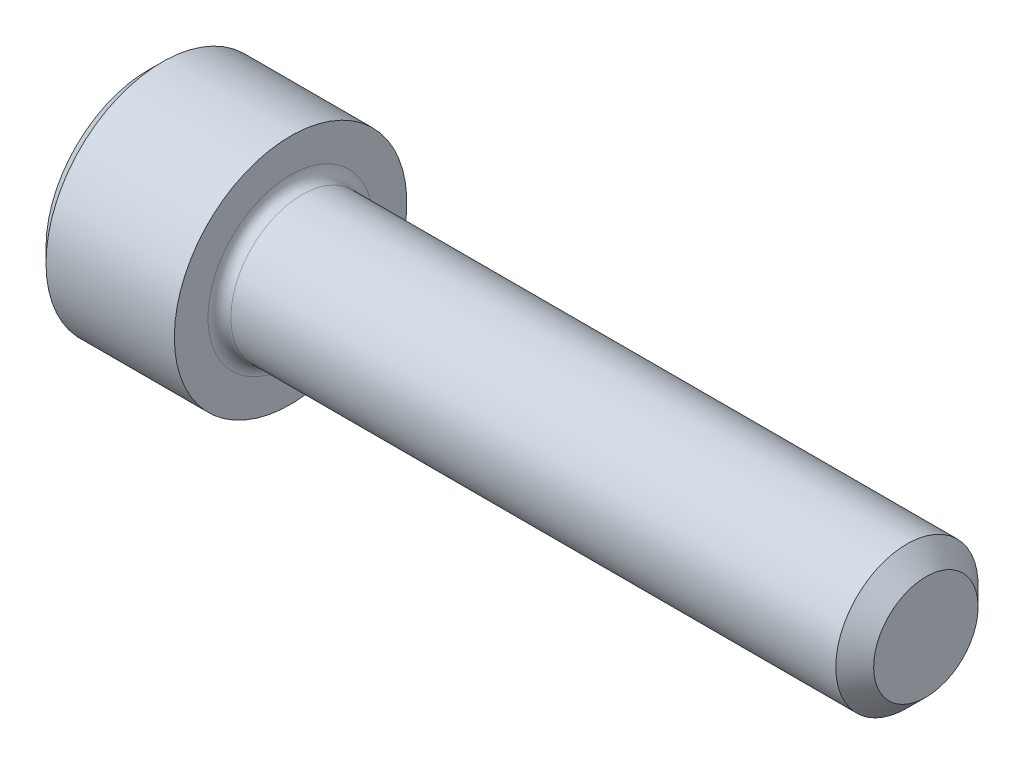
from build123d import *

# Parameters (mm, degrees)
FILLET1_R   = 0.2286
HEX_2_DEPTH = 1.2954


with BuildPart() as part:
    # BodySke → Base-Revolve (revolve)
    with BuildSketch(Plane.XY, mode=Mode.PRIVATE) as base_revolve_sk:
        Polygon((0, 0), (0, 2.0447), (0.2794, 2.3241), (2.8448, 2.3241), (2.8448, 1.4224), (15.16634, 1.4224), (15.5448, 1.04394), (15.5448, 0), align=None)
    revolve(base_revolve_sk.sketch.rotate(Axis((-31.75, 0, 0), (1, 0, 0)), 90), axis=Axis((-31.75, 0, 0), (1, 0, 0)))

    # Fillet1
    fillet1_edges = [part.edges().sort_by_distance(p)[0] for p in [
        (2.8448, 0, -1.4224),
    ]]
    fillet(fillet1_edges, radius=FILLET1_R)

    # Sketch2 → Hex-PreBroach (revolve, cut)
    with BuildSketch(Plane.XY, mode=Mode.PRIVATE) as hex_prebroach_sk:
        Polygon((0, 1.1938), (1.2954, 1.1938), (1.984640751, 0), (0, 0), align=None)
    revolve(hex_prebroach_sk.sketch.rotate(Axis((0, 0, 0), (1, 0, 0)), 90), axis=Axis((0, 0, 0), (1, 0, 0)), mode=Mode.SUBTRACT)

    # Sketch3 → Hex 2 (cut)
    with BuildSketch(Plane(origin=(0, 0, 0), x_dir=(0, 0.500000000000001, 0.866025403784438), z_dir=(-1, 0, 0))):
        Polygon((0.689240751, 1.1938), (-0.689240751, 1.1938), (-1.378481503, 0), (-0.689240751, -1.1938), (0.689240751, -1.1938), (1.378481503, 0), align=None)
    extrude(amount=-HEX_2_DEPTH, mode=Mode.SUBTRACT)


solid = part.part
